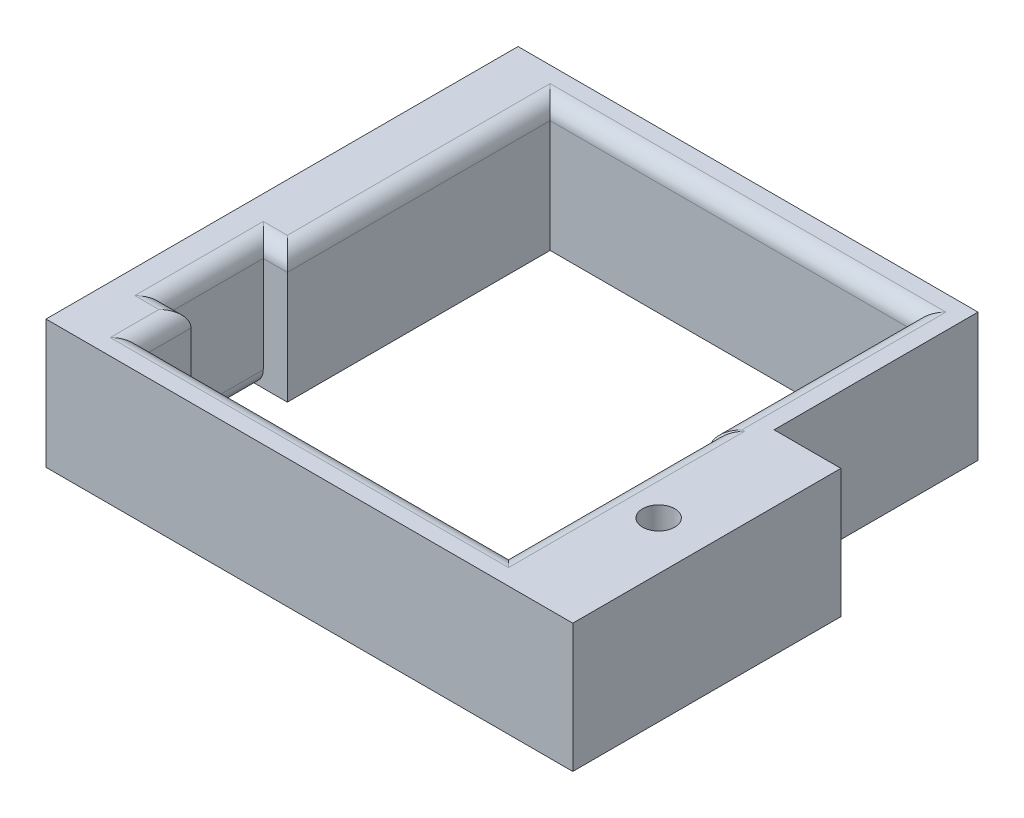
ISO-10303-21;
HEADER;
FILE_DESCRIPTION(('STEP AP214'),'2;1');
FILE_NAME('part.step','',(''),(''),'','','');
FILE_SCHEMA(('AUTOMOTIVE_DESIGN { 1 0 10303 214 1 1 1 1 }'));
ENDSEC;
DATA;
#1=APPLICATION_CONTEXT('core data for automotive mechanical design processes');
#2=APPLICATION_PROTOCOL_DEFINITION('international standard','automotive_design',2000,#1);
#3=PRODUCT_CONTEXT('',#1,'mechanical');
#4=PRODUCT('Part','Part','',(#3));
#5=PRODUCT_RELATED_PRODUCT_CATEGORY('part','',(#4));
#6=PRODUCT_DEFINITION_FORMATION('','',#4);
#7=PRODUCT_DEFINITION_CONTEXT('part definition',#1,'design');
#8=PRODUCT_DEFINITION('design','',#6,#7);
#9=PRODUCT_DEFINITION_SHAPE('','',#8);
#10=(LENGTH_UNIT() NAMED_UNIT(*) SI_UNIT(.MILLI.,.METRE.));
#11=(NAMED_UNIT(*) PLANE_ANGLE_UNIT() SI_UNIT($,.RADIAN.));
#12=(NAMED_UNIT(*) SI_UNIT($,.STERADIAN.) SOLID_ANGLE_UNIT());
#13=UNCERTAINTY_MEASURE_WITH_UNIT(LENGTH_MEASURE(1.E-05),#10,'distance_accuracy_value','');
#14=(GEOMETRIC_REPRESENTATION_CONTEXT(3) GLOBAL_UNCERTAINTY_ASSIGNED_CONTEXT((#13)) GLOBAL_UNIT_ASSIGNED_CONTEXT((#10,
#11,#12)) REPRESENTATION_CONTEXT('',''));
#15=CARTESIAN_POINT('',(0.,0.,0.));
#16=DIRECTION('',(0.,0.,1.));
#17=DIRECTION('',(1.,0.,0.));
#18=AXIS2_PLACEMENT_3D('',#15,#16,#17);
#19=CARTESIAN_POINT('',(4.,8.,-27.4));
#20=DIRECTION('',(1.,0.,0.));
#21=DIRECTION('',(0.,0.,-1.));
#22=AXIS2_PLACEMENT_3D('',#19,#20,#21);
#23=PLANE('',#22);
#24=DIRECTION('',(0.,1.,0.));
#25=VECTOR('',#24,1.);
#26=CARTESIAN_POINT('',(4.,0.,-5.03151166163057));
#27=LINE('',#26,#25);
#28=CARTESIAN_POINT('',(4.,0.,-5.03151166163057));
#29=VERTEX_POINT('',#28);
#30=CARTESIAN_POINT('',(4.,7.,-5.03151166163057));
#31=VERTEX_POINT('',#30);
#32=EDGE_CURVE('E179',#29,#31,#27,.T.);
#33=ORIENTED_EDGE('',*,*,#32,.T.);
#34=DIRECTION('',(0.,0.,1.));
#35=VECTOR('',#34,1.);
#36=CARTESIAN_POINT('',(4.,7.,-1.99999999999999));
#37=LINE('',#36,#35);
#38=CARTESIAN_POINT('',(4.,7.,-2.));
#39=VERTEX_POINT('',#38);
#40=EDGE_CURVE('E299',#31,#39,#37,.T.);
#41=ORIENTED_EDGE('',*,*,#40,.T.);
#42=DIRECTION('',(0.,-1.,0.));
#43=VECTOR('',#42,1.);
#44=CARTESIAN_POINT('',(4.,8.,-2.));
#45=LINE('',#44,#43);
#46=CARTESIAN_POINT('',(4.,0.,-2.));
#47=VERTEX_POINT('',#46);
#48=EDGE_CURVE('E204',#39,#47,#45,.T.);
#49=ORIENTED_EDGE('',*,*,#48,.T.);
#50=DIRECTION('',(0.,0.,1.));
#51=VECTOR('',#50,1.);
#52=CARTESIAN_POINT('',(4.,0.,-27.4));
#53=LINE('',#52,#51);
#54=EDGE_CURVE('E196',#29,#47,#53,.T.);
#55=ORIENTED_EDGE('',*,*,#54,.F.);
#56=EDGE_LOOP('',(#33,#41,#49,#55));
#57=FACE_BOUND('',#56,.T.);
#58=ADVANCED_FACE('F32',(#57),#23,.T.);
#59=CARTESIAN_POINT('',(0.,8.,0.));
#60=DIRECTION('',(0.,-1.,0.));
#61=DIRECTION('',(0.,0.,-1.));
#62=AXIS2_PLACEMENT_3D('',#59,#60,#61);
#63=PLANE('',#62);
#64=DIRECTION('',(1.,0.,0.));
#65=VECTOR('',#64,1.);
#66=CARTESIAN_POINT('',(4.,8.,-0.999999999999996));
#67=LINE('',#66,#65);
#68=CARTESIAN_POINT('',(27.81,8.,-0.999999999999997));
#69=VERTEX_POINT('',#68);
#70=CARTESIAN_POINT('',(3.,8.,-0.999999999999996));
#71=VERTEX_POINT('',#70);
#72=EDGE_CURVE('E289',#69,#71,#67,.F.);
#73=ORIENTED_EDGE('',*,*,#72,.T.);
#74=DIRECTION('',(0.,0.,1.));
#75=VECTOR('',#74,1.);
#76=CARTESIAN_POINT('',(3.,8.,-5.03151166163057));
#77=LINE('',#76,#75);
#78=CARTESIAN_POINT('',(3.,8.,-4.03151166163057));
#79=VERTEX_POINT('',#78);
#80=EDGE_CURVE('E291',#71,#79,#77,.F.);
#81=ORIENTED_EDGE('',*,*,#80,.T.);
#82=DIRECTION('',(1.,0.,0.));
#83=VECTOR('',#82,1.);
#84=CARTESIAN_POINT('',(0.,8.,-4.03151166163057));
#85=LINE('',#84,#83);
#86=CARTESIAN_POINT('',(1.5,8.,-4.03151166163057));
#87=VERTEX_POINT('',#86);
#88=EDGE_CURVE('E284',#79,#87,#85,.F.);
#89=ORIENTED_EDGE('',*,*,#88,.T.);
#90=DIRECTION('',(0.,0.,1.));
#91=VECTOR('',#90,1.);
#92=CARTESIAN_POINT('',(1.5,8.,0.));
#93=LINE('',#92,#91);
#94=CARTESIAN_POINT('',(1.5,8.,-12.0315116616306));
#95=VERTEX_POINT('',#94);
#96=EDGE_CURVE('E282',#87,#95,#93,.F.);
#97=ORIENTED_EDGE('',*,*,#96,.T.);
#98=DIRECTION('',(-1.,0.,0.));
#99=VECTOR('',#98,1.);
#100=CARTESIAN_POINT('',(0.,8.,-12.0315116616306));
#101=LINE('',#100,#99);
#102=CARTESIAN_POINT('',(3.,8.,-12.0315116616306));
#103=VERTEX_POINT('',#102);
#104=EDGE_CURVE('E280',#95,#103,#101,.F.);
#105=ORIENTED_EDGE('',*,*,#104,.T.);
#106=DIRECTION('',(0.,0.,1.));
#107=VECTOR('',#106,1.);
#108=CARTESIAN_POINT('',(3.,8.,-27.4));
#109=LINE('',#108,#107);
#110=CARTESIAN_POINT('',(3.,8.,-28.4));
#111=VERTEX_POINT('',#110);
#112=EDGE_CURVE('E272',#103,#111,#109,.F.);
#113=ORIENTED_EDGE('',*,*,#112,.T.);
#114=DIRECTION('',(-1.,0.,0.));
#115=VECTOR('',#114,1.);
#116=CARTESIAN_POINT('',(26.65,8.,-28.4));
#117=LINE('',#116,#115);
#118=CARTESIAN_POINT('',(27.65,8.,-28.4));
#119=VERTEX_POINT('',#118);
#120=EDGE_CURVE('E274',#111,#119,#117,.F.);
#121=ORIENTED_EDGE('',*,*,#120,.T.);
#122=DIRECTION('',(0.,0.,-1.));
#123=VECTOR('',#122,1.);
#124=CARTESIAN_POINT('',(27.65,8.,-14.7));
#125=LINE('',#124,#123);
#126=CARTESIAN_POINT('',(27.65,8.,-15.7));
#127=VERTEX_POINT('',#126);
#128=EDGE_CURVE('E276',#119,#127,#125,.F.);
#129=ORIENTED_EDGE('',*,*,#128,.T.);
#130=DIRECTION('',(-1.,0.,0.));
#131=VECTOR('',#130,1.);
#132=CARTESIAN_POINT('',(26.81,8.,-15.7));
#133=LINE('',#132,#131);
#134=CARTESIAN_POINT('',(27.81,8.,-15.7));
#135=VERTEX_POINT('',#134);
#136=EDGE_CURVE('E278',#127,#135,#133,.F.);
#137=ORIENTED_EDGE('',*,*,#136,.T.);
#138=DIRECTION('',(0.,0.,-1.));
#139=VECTOR('',#138,1.);
#140=CARTESIAN_POINT('',(27.81,8.,-2.));
#141=LINE('',#140,#139);
#142=EDGE_CURVE('E287',#135,#69,#141,.F.);
#143=ORIENTED_EDGE('',*,*,#142,.T.);
#144=EDGE_LOOP('',(#73,#81,#89,#97,#105,#113,#121,#129,#137,#143));
#145=FACE_BOUND('',#144,.T.);
#146=CARTESIAN_POINT('',(29.81,8.,-8.35));
#147=DIRECTION('',(0.,1.,0.));
#148=DIRECTION('',(0.,0.,1.));
#149=AXIS2_PLACEMENT_3D('',#146,#147,#148);
#150=CIRCLE('',#149,1.);
#151=CARTESIAN_POINT('',(29.81,8.,-7.35));
#152=VERTEX_POINT('',#151);
#153=EDGE_CURVE('E187',#152,#152,#150,.T.);
#154=ORIENTED_EDGE('',*,*,#153,.F.);
#155=EDGE_LOOP('',(#154));
#156=FACE_BOUND('',#155,.T.);
#157=DIRECTION('',(1.,0.,0.));
#158=VECTOR('',#157,1.);
#159=CARTESIAN_POINT('',(32.81,8.,0.));
#160=LINE('',#159,#158);
#161=CARTESIAN_POINT('',(0.,8.,0.));
#162=VERTEX_POINT('',#161);
#163=CARTESIAN_POINT('',(32.81,8.,0.));
#164=VERTEX_POINT('',#163);
#165=EDGE_CURVE('E228',#162,#164,#160,.T.);
#166=ORIENTED_EDGE('',*,*,#165,.T.);
#167=DIRECTION('',(0.,0.,-1.));
#168=VECTOR('',#167,1.);
#169=CARTESIAN_POINT('',(32.81,8.,-16.7));
#170=LINE('',#169,#168);
#171=CARTESIAN_POINT('',(32.81,8.,-16.7));
#172=VERTEX_POINT('',#171);
#173=EDGE_CURVE('E231',#164,#172,#170,.T.);
#174=ORIENTED_EDGE('',*,*,#173,.T.);
#175=DIRECTION('',(-1.,0.,0.));
#176=VECTOR('',#175,1.);
#177=CARTESIAN_POINT('',(28.65,8.,-16.7));
#178=LINE('',#177,#176);
#179=CARTESIAN_POINT('',(28.65,8.,-16.7));
#180=VERTEX_POINT('',#179);
#181=EDGE_CURVE('E234',#172,#180,#178,.T.);
#182=ORIENTED_EDGE('',*,*,#181,.T.);
#183=DIRECTION('',(0.,0.,-1.));
#184=VECTOR('',#183,1.);
#185=CARTESIAN_POINT('',(28.65,8.,-29.4));
#186=LINE('',#185,#184);
#187=CARTESIAN_POINT('',(28.65,8.,-29.4));
#188=VERTEX_POINT('',#187);
#189=EDGE_CURVE('E236',#180,#188,#186,.T.);
#190=ORIENTED_EDGE('',*,*,#189,.T.);
#191=DIRECTION('',(-1.,0.,0.));
#192=VECTOR('',#191,1.);
#193=CARTESIAN_POINT('',(0.,8.,-29.4));
#194=LINE('',#193,#192);
#195=CARTESIAN_POINT('',(0.,8.,-29.4));
#196=VERTEX_POINT('',#195);
#197=EDGE_CURVE('E238',#188,#196,#194,.T.);
#198=ORIENTED_EDGE('',*,*,#197,.T.);
#199=DIRECTION('',(0.,0.,1.));
#200=VECTOR('',#199,1.);
#201=CARTESIAN_POINT('',(0.,8.,0.));
#202=LINE('',#201,#200);
#203=EDGE_CURVE('E240',#196,#162,#202,.T.);
#204=ORIENTED_EDGE('',*,*,#203,.T.);
#205=EDGE_LOOP('',(#166,#174,#182,#190,#198,#204));
#206=FACE_BOUND('',#205,.T.);
#207=ADVANCED_FACE('F409',(#145,#156,#206),#63,.F.);
#208=CARTESIAN_POINT('',(0.,0.,0.));
#209=DIRECTION('',(0.,-1.,0.));
#210=DIRECTION('',(0.,0.,-1.));
#211=AXIS2_PLACEMENT_3D('',#208,#209,#210);
#212=PLANE('',#211);
#213=DIRECTION('',(0.,0.,1.));
#214=VECTOR('',#213,1.);
#215=CARTESIAN_POINT('',(1.5,0.,-5.03151166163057));
#216=LINE('',#215,#214);
#217=CARTESIAN_POINT('',(1.5,0.,-11.0315116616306));
#218=VERTEX_POINT('',#217);
#219=CARTESIAN_POINT('',(1.5,0.,-5.03151166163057));
#220=VERTEX_POINT('',#219);
#221=EDGE_CURVE('E199',#218,#220,#216,.T.);
#222=ORIENTED_EDGE('',*,*,#221,.T.);
#223=DIRECTION('',(1.,0.,0.));
#224=VECTOR('',#223,1.);
#225=CARTESIAN_POINT('',(4.,0.,-5.03151166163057));
#226=LINE('',#225,#224);
#227=EDGE_CURVE('E182',#220,#29,#226,.T.);
#228=ORIENTED_EDGE('',*,*,#227,.T.);
#229=ORIENTED_EDGE('',*,*,#54,.T.);
#230=DIRECTION('',(1.,0.,0.));
#231=VECTOR('',#230,1.);
#232=CARTESIAN_POINT('',(4.,0.,-2.));
#233=LINE('',#232,#231);
#234=CARTESIAN_POINT('',(26.81,0.,-2.));
#235=VERTEX_POINT('',#234);
#236=EDGE_CURVE('E209',#47,#235,#233,.T.);
#237=ORIENTED_EDGE('',*,*,#236,.T.);
#238=DIRECTION('',(0.,0.,-1.));
#239=VECTOR('',#238,1.);
#240=CARTESIAN_POINT('',(26.81,0.,-6.73909948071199));
#241=LINE('',#240,#239);
#242=CARTESIAN_POINT('',(26.81,0.,-14.7));
#243=VERTEX_POINT('',#242);
#244=EDGE_CURVE('E356',#235,#243,#241,.T.);
#245=ORIENTED_EDGE('',*,*,#244,.T.);
#246=DIRECTION('',(-1.,0.,0.));
#247=VECTOR('',#246,1.);
#248=CARTESIAN_POINT('',(26.81,0.,-14.7));
#249=LINE('',#248,#247);
#250=CARTESIAN_POINT('',(26.65,0.,-14.7));
#251=VERTEX_POINT('',#250);
#252=EDGE_CURVE('E361',#243,#251,#249,.T.);
#253=ORIENTED_EDGE('',*,*,#252,.T.);
#254=DIRECTION('',(0.,0.,-1.));
#255=VECTOR('',#254,1.);
#256=CARTESIAN_POINT('',(26.65,0.,-14.7));
#257=LINE('',#256,#255);
#258=CARTESIAN_POINT('',(26.65,0.,-27.4));
#259=VERTEX_POINT('',#258);
#260=EDGE_CURVE('E211',#251,#259,#257,.T.);
#261=ORIENTED_EDGE('',*,*,#260,.T.);
#262=DIRECTION('',(-1.,0.,0.));
#263=VECTOR('',#262,1.);
#264=CARTESIAN_POINT('',(26.65,0.,-27.4));
#265=LINE('',#264,#263);
#266=CARTESIAN_POINT('',(4.,0.,-27.4));
#267=VERTEX_POINT('',#266);
#268=EDGE_CURVE('E206',#259,#267,#265,.T.);
#269=ORIENTED_EDGE('',*,*,#268,.T.);
#270=CARTESIAN_POINT('',(4.,0.,-11.0315116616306));
#271=VERTEX_POINT('',#270);
#272=EDGE_CURVE('E205',#267,#271,#53,.T.);
#273=ORIENTED_EDGE('',*,*,#272,.T.);
#274=DIRECTION('',(-1.,0.,0.));
#275=VECTOR('',#274,1.);
#276=CARTESIAN_POINT('',(4.,0.,-11.0315116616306));
#277=LINE('',#276,#275);
#278=EDGE_CURVE('E201',#271,#218,#277,.T.);
#279=ORIENTED_EDGE('',*,*,#278,.T.);
#280=EDGE_LOOP('',(#222,#228,#229,#237,#245,#253,#261,#269,#273,#279));
#281=FACE_BOUND('',#280,.T.);
#282=CARTESIAN_POINT('',(29.81,0.,-8.35));
#283=DIRECTION('',(0.,1.,0.));
#284=DIRECTION('',(0.,0.,1.));
#285=AXIS2_PLACEMENT_3D('',#282,#283,#284);
#286=CIRCLE('',#285,1.);
#287=CARTESIAN_POINT('',(29.81,0.,-7.35));
#288=VERTEX_POINT('',#287);
#289=EDGE_CURVE('E353',#288,#288,#286,.T.);
#290=ORIENTED_EDGE('',*,*,#289,.T.);
#291=EDGE_LOOP('',(#290));
#292=FACE_BOUND('',#291,.T.);
#293=DIRECTION('',(1.,0.,0.));
#294=VECTOR('',#293,1.);
#295=CARTESIAN_POINT('',(32.81,0.,0.));
#296=LINE('',#295,#294);
#297=CARTESIAN_POINT('',(0.,0.,0.));
#298=VERTEX_POINT('',#297);
#299=CARTESIAN_POINT('',(32.81,0.,0.));
#300=VERTEX_POINT('',#299);
#301=EDGE_CURVE('E227',#298,#300,#296,.T.);
#302=ORIENTED_EDGE('',*,*,#301,.F.);
#303=DIRECTION('',(0.,0.,1.));
#304=VECTOR('',#303,1.);
#305=CARTESIAN_POINT('',(0.,0.,0.));
#306=LINE('',#305,#304);
#307=CARTESIAN_POINT('',(0.,0.,-29.4));
#308=VERTEX_POINT('',#307);
#309=EDGE_CURVE('E232',#308,#298,#306,.T.);
#310=ORIENTED_EDGE('',*,*,#309,.F.);
#311=DIRECTION('',(-1.,0.,0.));
#312=VECTOR('',#311,1.);
#313=CARTESIAN_POINT('',(0.,0.,-29.4));
#314=LINE('',#313,#312);
#315=CARTESIAN_POINT('',(28.65,0.,-29.4));
#316=VERTEX_POINT('',#315);
#317=EDGE_CURVE('E251',#316,#308,#314,.T.);
#318=ORIENTED_EDGE('',*,*,#317,.F.);
#319=DIRECTION('',(0.,0.,-1.));
#320=VECTOR('',#319,1.);
#321=CARTESIAN_POINT('',(28.65,0.,-29.4));
#322=LINE('',#321,#320);
#323=CARTESIAN_POINT('',(28.65,0.,-16.7));
#324=VERTEX_POINT('',#323);
#325=EDGE_CURVE('E249',#324,#316,#322,.T.);
#326=ORIENTED_EDGE('',*,*,#325,.F.);
#327=DIRECTION('',(-1.,0.,0.));
#328=VECTOR('',#327,1.);
#329=CARTESIAN_POINT('',(28.65,0.,-16.7));
#330=LINE('',#329,#328);
#331=CARTESIAN_POINT('',(32.81,0.,-16.7));
#332=VERTEX_POINT('',#331);
#333=EDGE_CURVE('E247',#332,#324,#330,.T.);
#334=ORIENTED_EDGE('',*,*,#333,.F.);
#335=DIRECTION('',(0.,0.,-1.));
#336=VECTOR('',#335,1.);
#337=CARTESIAN_POINT('',(32.81,0.,-16.7));
#338=LINE('',#337,#336);
#339=EDGE_CURVE('E245',#300,#332,#338,.T.);
#340=ORIENTED_EDGE('',*,*,#339,.F.);
#341=EDGE_LOOP('',(#302,#310,#318,#326,#334,#340));
#342=FACE_BOUND('',#341,.T.);
#343=ADVANCED_FACE('F193',(#281,#292,#342),#212,.T.);
#344=CARTESIAN_POINT('',(32.81,8.,0.));
#345=DIRECTION('',(0.,0.,-1.));
#346=DIRECTION('',(-1.,0.,0.));
#347=AXIS2_PLACEMENT_3D('',#344,#345,#346);
#348=PLANE('',#347);
#349=ORIENTED_EDGE('',*,*,#301,.T.);
#350=DIRECTION('',(0.,-1.,0.));
#351=VECTOR('',#350,1.);
#352=CARTESIAN_POINT('',(32.81,8.,0.));
#353=LINE('',#352,#351);
#354=EDGE_CURVE('E268',#164,#300,#353,.T.);
#355=ORIENTED_EDGE('',*,*,#354,.F.);
#356=ORIENTED_EDGE('',*,*,#165,.F.);
#357=DIRECTION('',(0.,-1.,0.));
#358=VECTOR('',#357,1.);
#359=CARTESIAN_POINT('',(0.,8.,0.));
#360=LINE('',#359,#358);
#361=EDGE_CURVE('E242',#162,#298,#360,.T.);
#362=ORIENTED_EDGE('',*,*,#361,.T.);
#363=EDGE_LOOP('',(#349,#355,#356,#362));
#364=FACE_BOUND('',#363,.T.);
#365=ADVANCED_FACE('F442',(#364),#348,.F.);
#366=CARTESIAN_POINT('',(32.81,8.,-16.7));
#367=DIRECTION('',(-1.,0.,0.));
#368=DIRECTION('',(0.,0.,1.));
#369=AXIS2_PLACEMENT_3D('',#366,#367,#368);
#370=PLANE('',#369);
#371=ORIENTED_EDGE('',*,*,#339,.T.);
#372=DIRECTION('',(0.,-1.,0.));
#373=VECTOR('',#372,1.);
#374=CARTESIAN_POINT('',(32.81,8.,-16.7));
#375=LINE('',#374,#373);
#376=EDGE_CURVE('E265',#172,#332,#375,.T.);
#377=ORIENTED_EDGE('',*,*,#376,.F.);
#378=ORIENTED_EDGE('',*,*,#173,.F.);
#379=ORIENTED_EDGE('',*,*,#354,.T.);
#380=EDGE_LOOP('',(#371,#377,#378,#379));
#381=FACE_BOUND('',#380,.T.);
#382=ADVANCED_FACE('F457',(#381),#370,.F.);
#383=CARTESIAN_POINT('',(28.65,8.,-16.7));
#384=DIRECTION('',(0.,0.,1.));
#385=DIRECTION('',(1.,0.,0.));
#386=AXIS2_PLACEMENT_3D('',#383,#384,#385);
#387=PLANE('',#386);
#388=ORIENTED_EDGE('',*,*,#333,.T.);
#389=DIRECTION('',(0.,-1.,0.));
#390=VECTOR('',#389,1.);
#391=CARTESIAN_POINT('',(28.65,8.,-16.7));
#392=LINE('',#391,#390);
#393=EDGE_CURVE('E262',#180,#324,#392,.T.);
#394=ORIENTED_EDGE('',*,*,#393,.F.);
#395=ORIENTED_EDGE('',*,*,#181,.F.);
#396=ORIENTED_EDGE('',*,*,#376,.T.);
#397=EDGE_LOOP('',(#388,#394,#395,#396));
#398=FACE_BOUND('',#397,.T.);
#399=ADVANCED_FACE('F453',(#398),#387,.F.);
#400=CARTESIAN_POINT('',(28.65,8.,-29.4));
#401=DIRECTION('',(-1.,0.,0.));
#402=DIRECTION('',(0.,0.,1.));
#403=AXIS2_PLACEMENT_3D('',#400,#401,#402);
#404=PLANE('',#403);
#405=ORIENTED_EDGE('',*,*,#325,.T.);
#406=DIRECTION('',(0.,-1.,0.));
#407=VECTOR('',#406,1.);
#408=CARTESIAN_POINT('',(28.65,8.,-29.4));
#409=LINE('',#408,#407);
#410=EDGE_CURVE('E259',#188,#316,#409,.T.);
#411=ORIENTED_EDGE('',*,*,#410,.F.);
#412=ORIENTED_EDGE('',*,*,#189,.F.);
#413=ORIENTED_EDGE('',*,*,#393,.T.);
#414=EDGE_LOOP('',(#405,#411,#412,#413));
#415=FACE_BOUND('',#414,.T.);
#416=ADVANCED_FACE('F449',(#415),#404,.F.);
#417=CARTESIAN_POINT('',(0.,8.,-29.4));
#418=DIRECTION('',(0.,0.,1.));
#419=DIRECTION('',(1.,0.,0.));
#420=AXIS2_PLACEMENT_3D('',#417,#418,#419);
#421=PLANE('',#420);
#422=ORIENTED_EDGE('',*,*,#317,.T.);
#423=DIRECTION('',(0.,-1.,0.));
#424=VECTOR('',#423,1.);
#425=CARTESIAN_POINT('',(0.,8.,-29.4));
#426=LINE('',#425,#424);
#427=EDGE_CURVE('E256',#196,#308,#426,.T.);
#428=ORIENTED_EDGE('',*,*,#427,.F.);
#429=ORIENTED_EDGE('',*,*,#197,.F.);
#430=ORIENTED_EDGE('',*,*,#410,.T.);
#431=EDGE_LOOP('',(#422,#428,#429,#430));
#432=FACE_BOUND('',#431,.T.);
#433=ADVANCED_FACE('F445',(#432),#421,.F.);
#434=CARTESIAN_POINT('',(0.,8.,0.));
#435=DIRECTION('',(1.,0.,0.));
#436=DIRECTION('',(0.,0.,-1.));
#437=AXIS2_PLACEMENT_3D('',#434,#435,#436);
#438=PLANE('',#437);
#439=ORIENTED_EDGE('',*,*,#309,.T.);
#440=ORIENTED_EDGE('',*,*,#361,.F.);
#441=ORIENTED_EDGE('',*,*,#203,.F.);
#442=ORIENTED_EDGE('',*,*,#427,.T.);
#443=EDGE_LOOP('',(#439,#440,#441,#442));
#444=FACE_BOUND('',#443,.T.);
#445=ADVANCED_FACE('F437',(#444),#438,.F.);
#446=CARTESIAN_POINT('',(26.81,8.,-6.73909948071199));
#447=DIRECTION('',(-1.,0.,0.));
#448=DIRECTION('',(0.,0.,1.));
#449=AXIS2_PLACEMENT_3D('',#446,#447,#448);
#450=PLANE('',#449);
#451=DIRECTION('',(0.,-1.,0.));
#452=VECTOR('',#451,1.);
#453=CARTESIAN_POINT('',(26.81,8.,-2.));
#454=LINE('',#453,#452);
#455=CARTESIAN_POINT('',(26.81,7.,-2.));
#456=VERTEX_POINT('',#455);
#457=EDGE_CURVE('E216',#456,#235,#454,.T.);
#458=ORIENTED_EDGE('',*,*,#457,.F.);
#459=DIRECTION('',(0.,0.,-1.));
#460=VECTOR('',#459,1.);
#461=CARTESIAN_POINT('',(26.81,7.,-14.7));
#462=LINE('',#461,#460);
#463=CARTESIAN_POINT('',(26.81,7.,-14.7));
#464=VERTEX_POINT('',#463);
#465=EDGE_CURVE('E305',#456,#464,#462,.T.);
#466=ORIENTED_EDGE('',*,*,#465,.T.);
#467=DIRECTION('',(0.,-1.,0.));
#468=VECTOR('',#467,1.);
#469=CARTESIAN_POINT('',(26.81,8.,-14.7));
#470=LINE('',#469,#468);
#471=EDGE_CURVE('E225',#464,#243,#470,.T.);
#472=ORIENTED_EDGE('',*,*,#471,.T.);
#473=ORIENTED_EDGE('',*,*,#244,.F.);
#474=EDGE_LOOP('',(#458,#466,#472,#473));
#475=FACE_BOUND('',#474,.T.);
#476=ADVANCED_FACE('F434',(#475),#450,.T.);
#477=CARTESIAN_POINT('',(26.81,8.,-14.7));
#478=DIRECTION('',(0.,0.,1.));
#479=DIRECTION('',(1.,0.,0.));
#480=AXIS2_PLACEMENT_3D('',#477,#478,#479);
#481=PLANE('',#480);
#482=ORIENTED_EDGE('',*,*,#471,.F.);
#483=DIRECTION('',(-1.,0.,0.));
#484=VECTOR('',#483,1.);
#485=CARTESIAN_POINT('',(26.65,7.,-14.7));
#486=LINE('',#485,#484);
#487=CARTESIAN_POINT('',(26.65,7.,-14.7));
#488=VERTEX_POINT('',#487);
#489=EDGE_CURVE('E303',#464,#488,#486,.T.);
#490=ORIENTED_EDGE('',*,*,#489,.T.);
#491=DIRECTION('',(0.,-1.,0.));
#492=VECTOR('',#491,1.);
#493=CARTESIAN_POINT('',(26.65,8.,-14.7));
#494=LINE('',#493,#492);
#495=EDGE_CURVE('E223',#488,#251,#494,.T.);
#496=ORIENTED_EDGE('',*,*,#495,.T.);
#497=ORIENTED_EDGE('',*,*,#252,.F.);
#498=EDGE_LOOP('',(#482,#490,#496,#497));
#499=FACE_BOUND('',#498,.T.);
#500=ADVANCED_FACE('F429',(#499),#481,.T.);
#501=CARTESIAN_POINT('',(26.65,8.,-14.7));
#502=DIRECTION('',(-1.,0.,0.));
#503=DIRECTION('',(0.,0.,1.));
#504=AXIS2_PLACEMENT_3D('',#501,#502,#503);
#505=PLANE('',#504);
#506=ORIENTED_EDGE('',*,*,#495,.F.);
#507=DIRECTION('',(0.,0.,-1.));
#508=VECTOR('',#507,1.);
#509=CARTESIAN_POINT('',(26.65,7.,-27.4));
#510=LINE('',#509,#508);
#511=CARTESIAN_POINT('',(26.65,7.,-27.4));
#512=VERTEX_POINT('',#511);
#513=EDGE_CURVE('E307',#488,#512,#510,.T.);
#514=ORIENTED_EDGE('',*,*,#513,.T.);
#515=DIRECTION('',(0.,-1.,0.));
#516=VECTOR('',#515,1.);
#517=CARTESIAN_POINT('',(26.65,8.,-27.4));
#518=LINE('',#517,#516);
#519=EDGE_CURVE('E221',#512,#259,#518,.T.);
#520=ORIENTED_EDGE('',*,*,#519,.T.);
#521=ORIENTED_EDGE('',*,*,#260,.F.);
#522=EDGE_LOOP('',(#506,#514,#520,#521));
#523=FACE_BOUND('',#522,.T.);
#524=ADVANCED_FACE('F369',(#523),#505,.T.);
#525=CARTESIAN_POINT('',(26.65,8.,-27.4));
#526=DIRECTION('',(0.,0.,1.));
#527=DIRECTION('',(1.,0.,0.));
#528=AXIS2_PLACEMENT_3D('',#525,#526,#527);
#529=PLANE('',#528);
#530=ORIENTED_EDGE('',*,*,#519,.F.);
#531=DIRECTION('',(-1.,0.,0.));
#532=VECTOR('',#531,1.);
#533=CARTESIAN_POINT('',(4.,7.,-27.4));
#534=LINE('',#533,#532);
#535=CARTESIAN_POINT('',(4.,7.,-27.4));
#536=VERTEX_POINT('',#535);
#537=EDGE_CURVE('E309',#512,#536,#534,.T.);
#538=ORIENTED_EDGE('',*,*,#537,.T.);
#539=DIRECTION('',(0.,-1.,0.));
#540=VECTOR('',#539,1.);
#541=CARTESIAN_POINT('',(4.,8.,-27.4));
#542=LINE('',#541,#540);
#543=EDGE_CURVE('E219',#536,#267,#542,.T.);
#544=ORIENTED_EDGE('',*,*,#543,.T.);
#545=ORIENTED_EDGE('',*,*,#268,.F.);
#546=EDGE_LOOP('',(#530,#538,#544,#545));
#547=FACE_BOUND('',#546,.T.);
#548=ADVANCED_FACE('F373',(#547),#529,.T.);
#549=ORIENTED_EDGE('',*,*,#543,.F.);
#550=DIRECTION('',(0.,0.,1.));
#551=VECTOR('',#550,1.);
#552=CARTESIAN_POINT('',(4.,7.,-11.0315116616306));
#553=LINE('',#552,#551);
#554=CARTESIAN_POINT('',(4.,7.,-11.0315116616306));
#555=VERTEX_POINT('',#554);
#556=EDGE_CURVE('E311',#536,#555,#553,.T.);
#557=ORIENTED_EDGE('',*,*,#556,.T.);
#558=DIRECTION('',(0.,1.,0.));
#559=VECTOR('',#558,1.);
#560=CARTESIAN_POINT('',(4.,0.,-11.0315116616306));
#561=LINE('',#560,#559);
#562=EDGE_CURVE('E200',#271,#555,#561,.T.);
#563=ORIENTED_EDGE('',*,*,#562,.F.);
#564=ORIENTED_EDGE('',*,*,#272,.F.);
#565=EDGE_LOOP('',(#549,#557,#563,#564));
#566=FACE_BOUND('',#565,.T.);
#567=ADVANCED_FACE('F379',(#566),#23,.T.);
#568=CARTESIAN_POINT('',(4.,8.,-2.));
#569=DIRECTION('',(0.,0.,-1.));
#570=DIRECTION('',(-1.,0.,0.));
#571=AXIS2_PLACEMENT_3D('',#568,#569,#570);
#572=PLANE('',#571);
#573=ORIENTED_EDGE('',*,*,#48,.F.);
#574=DIRECTION('',(1.,0.,0.));
#575=VECTOR('',#574,1.);
#576=CARTESIAN_POINT('',(26.81,7.,-2.));
#577=LINE('',#576,#575);
#578=EDGE_CURVE('E301',#39,#456,#577,.T.);
#579=ORIENTED_EDGE('',*,*,#578,.T.);
#580=ORIENTED_EDGE('',*,*,#457,.T.);
#581=ORIENTED_EDGE('',*,*,#236,.F.);
#582=EDGE_LOOP('',(#573,#579,#580,#581));
#583=FACE_BOUND('',#582,.T.);
#584=ADVANCED_FACE('F419',(#583),#572,.T.);
#585=CARTESIAN_POINT('',(29.81,0.,-8.35));
#586=DIRECTION('',(0.,1.,0.));
#587=DIRECTION('',(0.,0.,1.));
#588=AXIS2_PLACEMENT_3D('',#585,#586,#587);
#589=CYLINDRICAL_SURFACE('',#588,1.);
#590=ORIENTED_EDGE('',*,*,#289,.F.);
#591=EDGE_LOOP('',(#590));
#592=FACE_BOUND('',#591,.T.);
#593=ORIENTED_EDGE('',*,*,#153,.T.);
#594=EDGE_LOOP('',(#593));
#595=FACE_BOUND('',#594,.T.);
#596=ADVANCED_FACE('F424',(#592,#595),#589,.F.);
#597=CARTESIAN_POINT('',(4.,0.,-5.03151166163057));
#598=DIRECTION('',(0.,0.,1.));
#599=DIRECTION('',(1.,0.,0.));
#600=AXIS2_PLACEMENT_3D('',#597,#598,#599);
#601=PLANE('',#600);
#602=ORIENTED_EDGE('',*,*,#227,.F.);
#603=CARTESIAN_POINT('',(1.5,1.,-5.03151166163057));
#604=DIRECTION('',(0.,0.,1.));
#605=DIRECTION('',(1.,0.,0.));
#606=AXIS2_PLACEMENT_3D('',#603,#604,#605);
#607=CIRCLE('',#606,1.);
#608=CARTESIAN_POINT('',(2.5,1.,-5.03151166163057));
#609=VERTEX_POINT('',#608);
#610=EDGE_CURVE('E40',#220,#609,#607,.T.);
#611=ORIENTED_EDGE('',*,*,#610,.T.);
#612=DIRECTION('',(0.,1.,0.));
#613=VECTOR('',#612,1.);
#614=CARTESIAN_POINT('',(2.5,0.,-5.03151166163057));
#615=LINE('',#614,#613);
#616=CARTESIAN_POINT('',(2.5,7.,-5.03151166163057));
#617=VERTEX_POINT('',#616);
#618=EDGE_CURVE('E188',#609,#617,#615,.T.);
#619=ORIENTED_EDGE('',*,*,#618,.T.);
#620=DIRECTION('',(1.,0.,0.));
#621=VECTOR('',#620,1.);
#622=CARTESIAN_POINT('',(4.,7.,-5.03151166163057));
#623=LINE('',#622,#621);
#624=EDGE_CURVE('E184',#617,#31,#623,.T.);
#625=ORIENTED_EDGE('',*,*,#624,.T.);
#626=ORIENTED_EDGE('',*,*,#32,.F.);
#627=EDGE_LOOP('',(#602,#611,#619,#625,#626));
#628=FACE_BOUND('',#627,.T.);
#629=ADVANCED_FACE('F181',(#628),#601,.F.);
#630=CARTESIAN_POINT('',(2.5,0.,-11.0315116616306));
#631=DIRECTION('',(-1.,0.,0.));
#632=DIRECTION('',(0.,0.,1.));
#633=AXIS2_PLACEMENT_3D('',#630,#631,#632);
#634=PLANE('',#633);
#635=ORIENTED_EDGE('',*,*,#618,.F.);
#636=DIRECTION('',(0.,0.,1.));
#637=VECTOR('',#636,1.);
#638=CARTESIAN_POINT('',(2.5,1.,-11.0315116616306));
#639=LINE('',#638,#637);
#640=CARTESIAN_POINT('',(2.5,1.,-11.0315116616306));
#641=VERTEX_POINT('',#640);
#642=EDGE_CURVE('E53',#609,#641,#639,.F.);
#643=ORIENTED_EDGE('',*,*,#642,.T.);
#644=DIRECTION('',(0.,1.,0.));
#645=VECTOR('',#644,1.);
#646=CARTESIAN_POINT('',(2.5,0.,-11.0315116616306));
#647=LINE('',#646,#645);
#648=CARTESIAN_POINT('',(2.5,7.,-11.0315116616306));
#649=VERTEX_POINT('',#648);
#650=EDGE_CURVE('E349',#641,#649,#647,.T.);
#651=ORIENTED_EDGE('',*,*,#650,.T.);
#652=DIRECTION('',(0.,0.,1.));
#653=VECTOR('',#652,1.);
#654=CARTESIAN_POINT('',(2.5,7.,-11.0315116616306));
#655=LINE('',#654,#653);
#656=EDGE_CURVE('E293',#649,#617,#655,.T.);
#657=ORIENTED_EDGE('',*,*,#656,.T.);
#658=EDGE_LOOP('',(#635,#643,#651,#657));
#659=FACE_BOUND('',#658,.T.);
#660=ADVANCED_FACE('F397',(#659),#634,.F.);
#661=CARTESIAN_POINT('',(4.,0.,-11.0315116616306));
#662=DIRECTION('',(0.,0.,-1.));
#663=DIRECTION('',(-1.,0.,0.));
#664=AXIS2_PLACEMENT_3D('',#661,#662,#663);
#665=PLANE('',#664);
#666=ORIENTED_EDGE('',*,*,#562,.T.);
#667=DIRECTION('',(-1.,0.,0.));
#668=VECTOR('',#667,1.);
#669=CARTESIAN_POINT('',(4.,7.,-11.0315116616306));
#670=LINE('',#669,#668);
#671=EDGE_CURVE('E296',#555,#649,#670,.T.);
#672=ORIENTED_EDGE('',*,*,#671,.T.);
#673=ORIENTED_EDGE('',*,*,#650,.F.);
#674=CARTESIAN_POINT('',(1.5,1.,-11.0315116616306));
#675=DIRECTION('',(0.,0.,-1.));
#676=DIRECTION('',(-1.,0.,0.));
#677=AXIS2_PLACEMENT_3D('',#674,#675,#676);
#678=CIRCLE('',#677,1.);
#679=EDGE_CURVE('E11',#641,#218,#678,.T.);
#680=ORIENTED_EDGE('',*,*,#679,.T.);
#681=ORIENTED_EDGE('',*,*,#278,.F.);
#682=EDGE_LOOP('',(#666,#672,#673,#680,#681));
#683=FACE_BOUND('',#682,.T.);
#684=ADVANCED_FACE('F383',(#683),#665,.F.);
#685=CARTESIAN_POINT('',(27.65,7.,-14.7));
#686=DIRECTION('',(0.,0.,1.));
#687=DIRECTION('',(1.,0.,0.));
#688=AXIS2_PLACEMENT_3D('',#685,#686,#687);
#689=CYLINDRICAL_SURFACE('',#688,1.);
#690=CARTESIAN_POINT('',(27.65,7.,-15.7));
#691=DIRECTION('',(0.707106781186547,0.,0.707106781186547));
#692=DIRECTION('',(-0.707106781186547,0.,0.707106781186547));
#693=AXIS2_PLACEMENT_3D('',#690,#691,#692);
#694=ELLIPSE('',#693,1.41421356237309,1.);
#695=EDGE_CURVE('E335',#127,#488,#694,.T.);
#696=ORIENTED_EDGE('',*,*,#695,.F.);
#697=ORIENTED_EDGE('',*,*,#128,.F.);
#698=CARTESIAN_POINT('',(27.65,7.,-28.4));
#699=DIRECTION('',(0.707106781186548,0.,0.707106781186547));
#700=DIRECTION('',(-0.707106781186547,0.,0.707106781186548));
#701=AXIS2_PLACEMENT_3D('',#698,#699,#700);
#702=ELLIPSE('',#701,1.4142135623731,1.);
#703=EDGE_CURVE('E338',#512,#119,#702,.F.);
#704=ORIENTED_EDGE('',*,*,#703,.F.);
#705=ORIENTED_EDGE('',*,*,#513,.F.);
#706=EDGE_LOOP('',(#696,#697,#704,#705));
#707=FACE_BOUND('',#706,.T.);
#708=ADVANCED_FACE('F488',(#707),#689,.T.);
#709=CARTESIAN_POINT('',(26.65,7.,-28.4));
#710=DIRECTION('',(1.,0.,0.));
#711=DIRECTION('',(0.,0.,-1.));
#712=AXIS2_PLACEMENT_3D('',#709,#710,#711);
#713=CYLINDRICAL_SURFACE('',#712,1.);
#714=ORIENTED_EDGE('',*,*,#703,.T.);
#715=ORIENTED_EDGE('',*,*,#120,.F.);
#716=CARTESIAN_POINT('',(3.,7.,-28.4));
#717=DIRECTION('',(0.707106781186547,0.,-0.707106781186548));
#718=DIRECTION('',(0.707106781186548,0.,0.707106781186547));
#719=AXIS2_PLACEMENT_3D('',#716,#717,#718);
#720=ELLIPSE('',#719,1.41421356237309,1.);
#721=EDGE_CURVE('E332',#536,#111,#720,.F.);
#722=ORIENTED_EDGE('',*,*,#721,.F.);
#723=ORIENTED_EDGE('',*,*,#537,.F.);
#724=EDGE_LOOP('',(#714,#715,#722,#723));
#725=FACE_BOUND('',#724,.T.);
#726=ADVANCED_FACE('F485',(#725),#713,.T.);
#727=CARTESIAN_POINT('',(26.81,7.,-15.7));
#728=DIRECTION('',(1.,0.,0.));
#729=DIRECTION('',(0.,0.,-1.));
#730=AXIS2_PLACEMENT_3D('',#727,#728,#729);
#731=CYLINDRICAL_SURFACE('',#730,1.);
#732=ORIENTED_EDGE('',*,*,#695,.T.);
#733=ORIENTED_EDGE('',*,*,#489,.F.);
#734=CARTESIAN_POINT('',(27.81,7.,-15.7));
#735=DIRECTION('',(0.707106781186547,0.,0.707106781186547));
#736=DIRECTION('',(0.707106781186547,0.,-0.707106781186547));
#737=AXIS2_PLACEMENT_3D('',#734,#735,#736);
#738=ELLIPSE('',#737,1.41421356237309,1.);
#739=EDGE_CURVE('E329',#135,#464,#738,.T.);
#740=ORIENTED_EDGE('',*,*,#739,.F.);
#741=ORIENTED_EDGE('',*,*,#136,.F.);
#742=EDGE_LOOP('',(#732,#733,#740,#741));
#743=FACE_BOUND('',#742,.T.);
#744=ADVANCED_FACE('F482',(#743),#731,.T.);
#745=CARTESIAN_POINT('',(3.,7.,-27.4));
#746=DIRECTION('',(0.,0.,-1.));
#747=DIRECTION('',(-1.,0.,0.));
#748=AXIS2_PLACEMENT_3D('',#745,#746,#747);
#749=CYLINDRICAL_SURFACE('',#748,1.);
#750=ORIENTED_EDGE('',*,*,#721,.T.);
#751=ORIENTED_EDGE('',*,*,#112,.F.);
#752=CARTESIAN_POINT('',(3.,7.,-12.0315116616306));
#753=DIRECTION('',(0.707106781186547,0.,-0.707106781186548));
#754=DIRECTION('',(-0.707106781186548,0.,-0.707106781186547));
#755=AXIS2_PLACEMENT_3D('',#752,#753,#754);
#756=ELLIPSE('',#755,1.4142135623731,1.);
#757=EDGE_CURVE('E326',#555,#103,#756,.F.);
#758=ORIENTED_EDGE('',*,*,#757,.F.);
#759=ORIENTED_EDGE('',*,*,#556,.F.);
#760=EDGE_LOOP('',(#750,#751,#758,#759));
#761=FACE_BOUND('',#760,.T.);
#762=ADVANCED_FACE('F388',(#761),#749,.T.);
#763=CARTESIAN_POINT('',(27.81,7.,-6.73909948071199));
#764=DIRECTION('',(0.,0.,1.));
#765=DIRECTION('',(1.,0.,0.));
#766=AXIS2_PLACEMENT_3D('',#763,#764,#765);
#767=CYLINDRICAL_SURFACE('',#766,1.);
#768=ORIENTED_EDGE('',*,*,#739,.T.);
#769=ORIENTED_EDGE('',*,*,#465,.F.);
#770=CARTESIAN_POINT('',(27.81,7.,-0.999999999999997));
#771=DIRECTION('',(-0.707106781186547,0.,0.707106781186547));
#772=DIRECTION('',(-0.707106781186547,0.,-0.707106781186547));
#773=AXIS2_PLACEMENT_3D('',#770,#771,#772);
#774=ELLIPSE('',#773,1.41421356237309,1.);
#775=EDGE_CURVE('E323',#69,#456,#774,.T.);
#776=ORIENTED_EDGE('',*,*,#775,.F.);
#777=ORIENTED_EDGE('',*,*,#142,.F.);
#778=EDGE_LOOP('',(#768,#769,#776,#777));
#779=FACE_BOUND('',#778,.T.);
#780=ADVANCED_FACE('F476',(#779),#767,.T.);
#781=CARTESIAN_POINT('',(4.,7.,-12.0315116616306));
#782=DIRECTION('',(-1.,0.,0.));
#783=DIRECTION('',(0.,0.,1.));
#784=AXIS2_PLACEMENT_3D('',#781,#782,#783);
#785=CYLINDRICAL_SURFACE('',#784,1.);
#786=ORIENTED_EDGE('',*,*,#757,.T.);
#787=ORIENTED_EDGE('',*,*,#104,.F.);
#788=CARTESIAN_POINT('',(1.5,7.,-12.0315116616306));
#789=DIRECTION('',(-0.707106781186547,0.,0.707106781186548));
#790=DIRECTION('',(0.707106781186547,0.,0.707106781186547));
#791=AXIS2_PLACEMENT_3D('',#788,#789,#790);
#792=ELLIPSE('',#791,1.4142135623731,1.);
#793=EDGE_CURVE('E320',#649,#95,#792,.T.);
#794=ORIENTED_EDGE('',*,*,#793,.F.);
#795=ORIENTED_EDGE('',*,*,#671,.F.);
#796=EDGE_LOOP('',(#786,#787,#794,#795));
#797=FACE_BOUND('',#796,.T.);
#798=ADVANCED_FACE('F391',(#797),#785,.T.);
#799=CARTESIAN_POINT('',(4.,7.,-0.999999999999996));
#800=DIRECTION('',(-1.,0.,0.));
#801=DIRECTION('',(0.,0.,1.));
#802=AXIS2_PLACEMENT_3D('',#799,#800,#801);
#803=CYLINDRICAL_SURFACE('',#802,1.);
#804=ORIENTED_EDGE('',*,*,#775,.T.);
#805=ORIENTED_EDGE('',*,*,#578,.F.);
#806=CARTESIAN_POINT('',(3.,7.,-0.999999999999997));
#807=DIRECTION('',(-0.707106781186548,0.,-0.707106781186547));
#808=DIRECTION('',(0.707106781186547,0.,-0.707106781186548));
#809=AXIS2_PLACEMENT_3D('',#806,#807,#808);
#810=ELLIPSE('',#809,1.41421356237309,1.);
#811=EDGE_CURVE('E317',#71,#39,#810,.T.);
#812=ORIENTED_EDGE('',*,*,#811,.F.);
#813=ORIENTED_EDGE('',*,*,#72,.F.);
#814=EDGE_LOOP('',(#804,#805,#812,#813));
#815=FACE_BOUND('',#814,.T.);
#816=ADVANCED_FACE('F470',(#815),#803,.T.);
#817=CARTESIAN_POINT('',(1.5,7.,-11.0315116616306));
#818=DIRECTION('',(0.,0.,1.));
#819=DIRECTION('',(1.,0.,0.));
#820=AXIS2_PLACEMENT_3D('',#817,#818,#819);
#821=CYLINDRICAL_SURFACE('',#820,1.);
#822=ORIENTED_EDGE('',*,*,#793,.T.);
#823=ORIENTED_EDGE('',*,*,#96,.F.);
#824=CARTESIAN_POINT('',(1.5,7.,-4.03151166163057));
#825=DIRECTION('',(0.707106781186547,0.,0.707106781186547));
#826=DIRECTION('',(0.707106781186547,0.,-0.707106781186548));
#827=AXIS2_PLACEMENT_3D('',#824,#825,#826);
#828=ELLIPSE('',#827,1.41421356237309,1.);
#829=EDGE_CURVE('E315',#617,#87,#828,.T.);
#830=ORIENTED_EDGE('',*,*,#829,.F.);
#831=ORIENTED_EDGE('',*,*,#656,.F.);
#832=EDGE_LOOP('',(#822,#823,#830,#831));
#833=FACE_BOUND('',#832,.T.);
#834=ADVANCED_FACE('F396',(#833),#821,.T.);
#835=CARTESIAN_POINT('',(3.,7.,-27.4));
#836=DIRECTION('',(0.,0.,-1.));
#837=DIRECTION('',(-1.,0.,0.));
#838=AXIS2_PLACEMENT_3D('',#835,#836,#837);
#839=CYLINDRICAL_SURFACE('',#838,1.);
#840=ORIENTED_EDGE('',*,*,#811,.T.);
#841=ORIENTED_EDGE('',*,*,#40,.F.);
#842=CARTESIAN_POINT('',(3.,7.,-4.03151166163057));
#843=DIRECTION('',(-0.707106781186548,0.,-0.707106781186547));
#844=DIRECTION('',(0.707106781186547,0.,-0.707106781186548));
#845=AXIS2_PLACEMENT_3D('',#842,#843,#844);
#846=ELLIPSE('',#845,1.41421356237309,1.);
#847=EDGE_CURVE('E313',#79,#31,#846,.T.);
#848=ORIENTED_EDGE('',*,*,#847,.F.);
#849=ORIENTED_EDGE('',*,*,#80,.F.);
#850=EDGE_LOOP('',(#840,#841,#848,#849));
#851=FACE_BOUND('',#850,.T.);
#852=ADVANCED_FACE('F405',(#851),#839,.T.);
#853=CARTESIAN_POINT('',(4.,7.,-4.03151166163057));
#854=DIRECTION('',(1.,0.,0.));
#855=DIRECTION('',(0.,0.,-1.));
#856=AXIS2_PLACEMENT_3D('',#853,#854,#855);
#857=CYLINDRICAL_SURFACE('',#856,1.);
#858=ORIENTED_EDGE('',*,*,#829,.T.);
#859=ORIENTED_EDGE('',*,*,#88,.F.);
#860=ORIENTED_EDGE('',*,*,#847,.T.);
#861=ORIENTED_EDGE('',*,*,#624,.F.);
#862=EDGE_LOOP('',(#858,#859,#860,#861));
#863=FACE_BOUND('',#862,.T.);
#864=ADVANCED_FACE('F401',(#863),#857,.T.);
#865=CARTESIAN_POINT('',(1.5,1.,0.));
#866=DIRECTION('',(0.,0.,-1.));
#867=DIRECTION('',(-1.,0.,0.));
#868=AXIS2_PLACEMENT_3D('',#865,#866,#867);
#869=CYLINDRICAL_SURFACE('',#868,1.);
#870=ORIENTED_EDGE('',*,*,#679,.F.);
#871=ORIENTED_EDGE('',*,*,#642,.F.);
#872=ORIENTED_EDGE('',*,*,#610,.F.);
#873=ORIENTED_EDGE('',*,*,#221,.F.);
#874=EDGE_LOOP('',(#870,#871,#872,#873));
#875=FACE_BOUND('',#874,.T.);
#876=ADVANCED_FACE('F34',(#875),#869,.T.);
#877=CLOSED_SHELL('',(#58,#207,#343,#365,#382,#399,#416,#433,#445,#476,#500,#524,#548,#567,#584,
#596,#629,#660,#684,#708,#726,#744,#762,#780,#798,#816,#834,#852,#864,#876));
#878=MANIFOLD_SOLID_BREP('B2',#877);
#879=ADVANCED_BREP_SHAPE_REPRESENTATION('',(#18,#878),#14);
#880=SHAPE_DEFINITION_REPRESENTATION(#9,#879);
ENDSEC;
END-ISO-10303-21;
